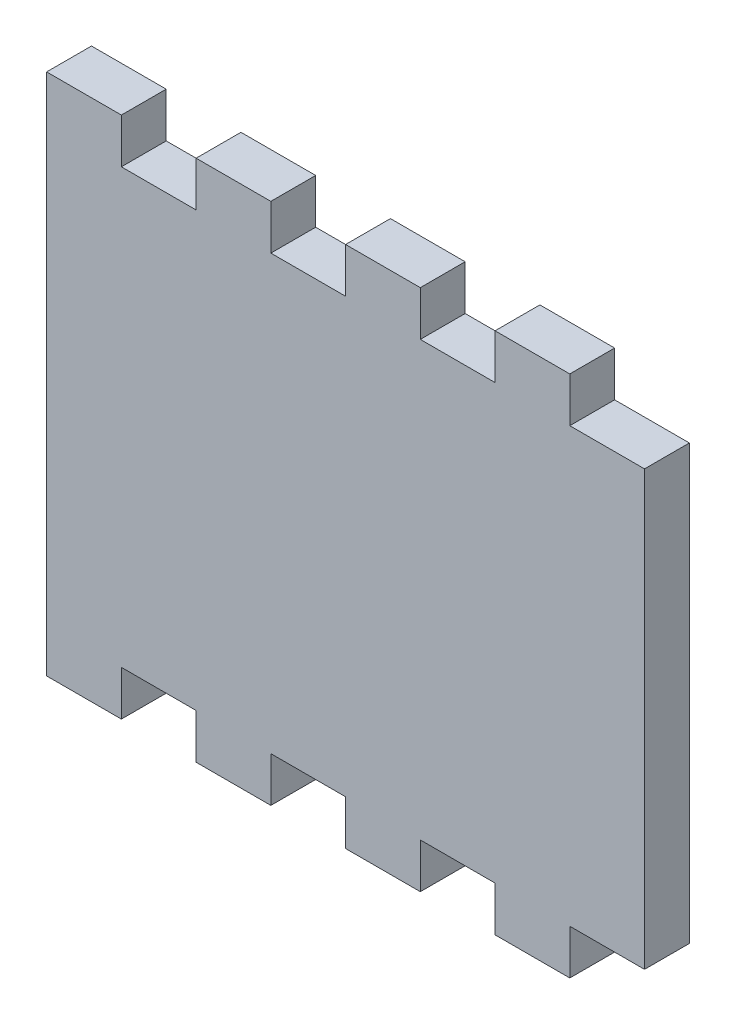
from build123d import *

# Parameters (mm, degrees)
ESTRUSIONE_ESTRUSIONE1_DEPTH = 6


with BuildPart() as part:
    # Schizzo1 → Estrusione-Estrusione1 (new body)
    with BuildSketch(Plane.XY):
        Polygon((-40, 35), (-30, 35), (-30, 29), (-20, 29), (-20, 35), (-10, 35), (-10, 29), (0, 29), (0, 35), (10, 35), (10, 29), (20, 29), (20, 35), (30, 35), (30, 29), (40, 29), (40, -29), (30, -29), (30, -35), (20, -35), (20, -29), (10, -29), (10, -35), (0, -35), (0, -29), (-10, -29), (-10, -35), (-20, -35), (-20, -29), (-30, -29), (-30, -35), (-40, -35), align=None)
    extrude(amount=ESTRUSIONE_ESTRUSIONE1_DEPTH)


solid = part.part
